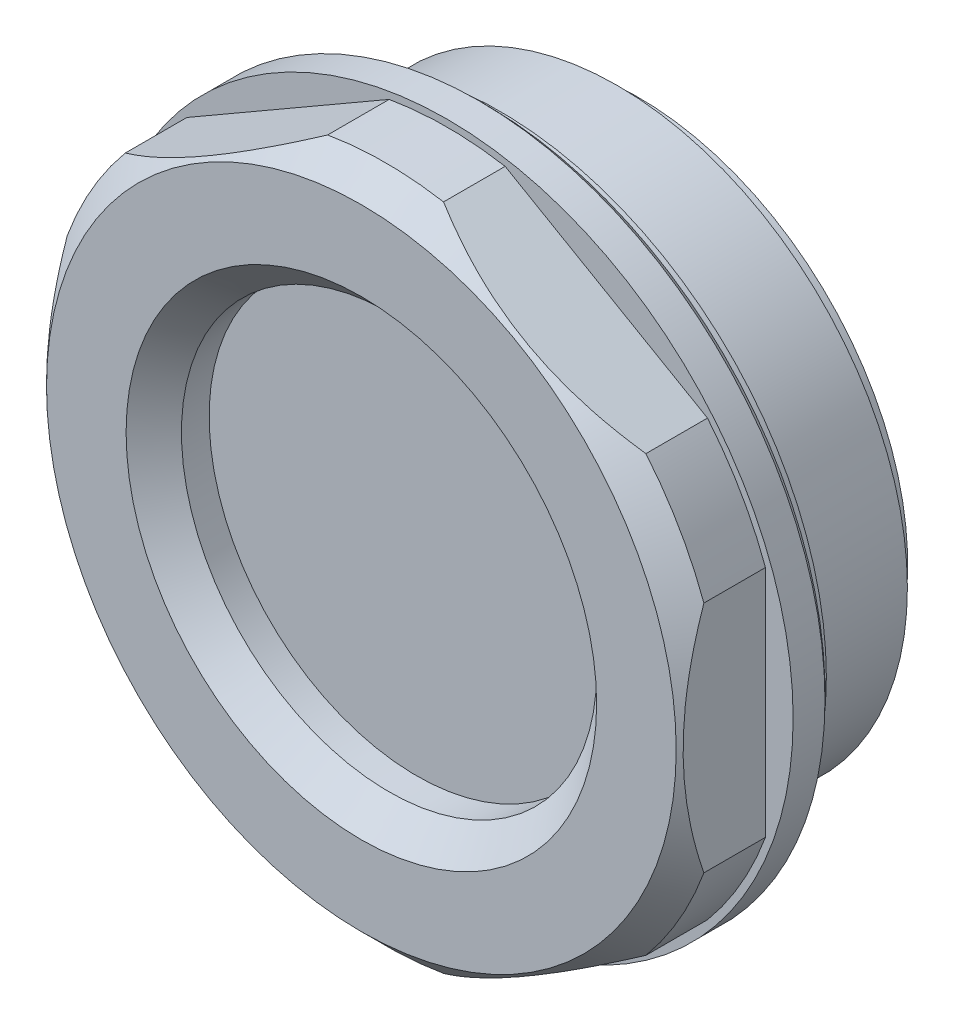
ISO-10303-21;
HEADER;
FILE_DESCRIPTION(('STEP AP214'),'2;1');
FILE_NAME('part.step','',(''),(''),'','','');
FILE_SCHEMA(('AUTOMOTIVE_DESIGN { 1 0 10303 214 1 1 1 1 }'));
ENDSEC;
DATA;
#1=APPLICATION_CONTEXT('core data for automotive mechanical design processes');
#2=APPLICATION_PROTOCOL_DEFINITION('international standard','automotive_design',2000,#1);
#3=PRODUCT_CONTEXT('',#1,'mechanical');
#4=PRODUCT('Part','Part','',(#3));
#5=PRODUCT_RELATED_PRODUCT_CATEGORY('part','',(#4));
#6=PRODUCT_DEFINITION_FORMATION('','',#4);
#7=PRODUCT_DEFINITION_CONTEXT('part definition',#1,'design');
#8=PRODUCT_DEFINITION('design','',#6,#7);
#9=PRODUCT_DEFINITION_SHAPE('','',#8);
#10=(LENGTH_UNIT() NAMED_UNIT(*) SI_UNIT(.MILLI.,.METRE.));
#11=(NAMED_UNIT(*) PLANE_ANGLE_UNIT() SI_UNIT($,.RADIAN.));
#12=(NAMED_UNIT(*) SI_UNIT($,.STERADIAN.) SOLID_ANGLE_UNIT());
#13=UNCERTAINTY_MEASURE_WITH_UNIT(LENGTH_MEASURE(1.E-05),#10,'distance_accuracy_value','');
#14=(GEOMETRIC_REPRESENTATION_CONTEXT(3) GLOBAL_UNCERTAINTY_ASSIGNED_CONTEXT((#13)) GLOBAL_UNIT_ASSIGNED_CONTEXT((#10,
#11,#12)) REPRESENTATION_CONTEXT('',''));
#15=CARTESIAN_POINT('',(0.,0.,0.));
#16=DIRECTION('',(0.,0.,1.));
#17=DIRECTION('',(1.,0.,0.));
#18=AXIS2_PLACEMENT_3D('',#15,#16,#17);
#19=CARTESIAN_POINT('',(0.,0.,-15.6719004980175));
#20=DIRECTION('',(0.,0.,-1.));
#21=DIRECTION('',(-1.,0.,0.));
#22=AXIS2_PLACEMENT_3D('',#19,#20,#21);
#23=CYLINDRICAL_SURFACE('',#22,24.5);
#24=CARTESIAN_POINT('',(0.,0.,8.24999999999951));
#25=DIRECTION('',(0.,0.,-1.));
#26=DIRECTION('',(-1.,0.,0.));
#27=AXIS2_PLACEMENT_3D('',#24,#25,#26);
#28=CIRCLE('',#27,24.5);
#29=CARTESIAN_POINT('',(4.18990418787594,-24.1390700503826,8.24999999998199));
#30=VERTEX_POINT('',#29);
#31=CARTESIAN_POINT('',(-4.18990418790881,-24.1390700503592,8.24999999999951));
#32=VERTEX_POINT('',#31);
#33=EDGE_CURVE('E352',#30,#32,#28,.T.);
#34=ORIENTED_EDGE('',*,*,#33,.T.);
#35=DIRECTION('',(0.,0.,1.));
#36=VECTOR('',#35,1.);
#37=CARTESIAN_POINT('',(-4.18990418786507,-24.1390700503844,3.8));
#38=LINE('',#37,#36);
#39=CARTESIAN_POINT('',(-4.18990418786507,-24.1390700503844,3.8));
#40=VERTEX_POINT('',#39);
#41=EDGE_CURVE('E43',#40,#32,#38,.T.);
#42=ORIENTED_EDGE('',*,*,#41,.F.);
#43=CARTESIAN_POINT('',(0.,0.,3.8));
#44=DIRECTION('',(0.,0.,-1.));
#45=DIRECTION('',(-1.,0.,0.));
#46=AXIS2_PLACEMENT_3D('',#43,#44,#45);
#47=CIRCLE('',#46,24.5);
#48=CARTESIAN_POINT('',(4.18990418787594,-24.1390700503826,3.8));
#49=VERTEX_POINT('',#48);
#50=EDGE_CURVE('E128',#49,#40,#47,.T.);
#51=ORIENTED_EDGE('',*,*,#50,.F.);
#52=DIRECTION('',(0.,0.,1.));
#53=VECTOR('',#52,1.);
#54=CARTESIAN_POINT('',(4.18990418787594,-24.1390700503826,3.8));
#55=LINE('',#54,#53);
#56=EDGE_CURVE('E107',#49,#30,#55,.T.);
#57=ORIENTED_EDGE('',*,*,#56,.T.);
#58=EDGE_LOOP('',(#34,#42,#51,#57));
#59=FACE_BOUND('',#58,.T.);
#60=ADVANCED_FACE('F14',(#59),#23,.T.);
#61=CARTESIAN_POINT('',(-18.8100957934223,-15.698098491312,3.8));
#62=VERTEX_POINT('',#61);
#63=CARTESIAN_POINT('',(-22.9999999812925,-8.44097155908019,3.8));
#64=VERTEX_POINT('',#63);
#65=EDGE_CURVE('E134',#62,#64,#47,.T.);
#66=ORIENTED_EDGE('',*,*,#65,.F.);
#67=DIRECTION('',(0.,0.,1.));
#68=VECTOR('',#67,1.);
#69=CARTESIAN_POINT('',(-18.8100957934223,-15.698098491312,3.8));
#70=LINE('',#69,#68);
#71=CARTESIAN_POINT('',(-18.8100957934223,-15.698098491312,8.24999999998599));
#72=VERTEX_POINT('',#71);
#73=EDGE_CURVE('E316',#62,#72,#70,.T.);
#74=ORIENTED_EDGE('',*,*,#73,.T.);
#75=CARTESIAN_POINT('',(-22.9999999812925,-8.44097155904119,8.24999999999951));
#76=VERTEX_POINT('',#75);
#77=EDGE_CURVE('E348',#72,#76,#28,.T.);
#78=ORIENTED_EDGE('',*,*,#77,.T.);
#79=DIRECTION('',(0.,0.,1.));
#80=VECTOR('',#79,1.);
#81=CARTESIAN_POINT('',(-22.9999999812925,-8.44097155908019,3.8));
#82=LINE('',#81,#80);
#83=EDGE_CURVE('E35',#64,#76,#82,.T.);
#84=ORIENTED_EDGE('',*,*,#83,.F.);
#85=EDGE_LOOP('',(#66,#74,#78,#84));
#86=FACE_BOUND('',#85,.T.);
#87=ADVANCED_FACE('F257',(#86),#23,.T.);
#88=CARTESIAN_POINT('',(-22.9999999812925,8.44097155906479,3.8));
#89=VERTEX_POINT('',#88);
#90=CARTESIAN_POINT('',(-18.8100957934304,15.6980984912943,3.8));
#91=VERTEX_POINT('',#90);
#92=EDGE_CURVE('E139',#89,#91,#47,.T.);
#93=ORIENTED_EDGE('',*,*,#92,.F.);
#94=DIRECTION('',(0.,0.,1.));
#95=VECTOR('',#94,1.);
#96=CARTESIAN_POINT('',(-22.9999999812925,8.44097155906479,3.8));
#97=LINE('',#96,#95);
#98=CARTESIAN_POINT('',(-22.9999999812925,8.44097155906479,8.24999999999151));
#99=VERTEX_POINT('',#98);
#100=EDGE_CURVE('E312',#89,#99,#97,.T.);
#101=ORIENTED_EDGE('',*,*,#100,.T.);
#102=CARTESIAN_POINT('',(-18.81009579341,15.6980984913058,8.24999999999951));
#103=VERTEX_POINT('',#102);
#104=EDGE_CURVE('E138',#99,#103,#28,.T.);
#105=ORIENTED_EDGE('',*,*,#104,.T.);
#106=DIRECTION('',(0.,0.,1.));
#107=VECTOR('',#106,1.);
#108=CARTESIAN_POINT('',(-18.8100957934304,15.6980984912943,3.8));
#109=LINE('',#108,#107);
#110=EDGE_CURVE('E306',#91,#103,#109,.T.);
#111=ORIENTED_EDGE('',*,*,#110,.F.);
#112=EDGE_LOOP('',(#93,#101,#105,#111));
#113=FACE_BOUND('',#112,.T.);
#114=ADVANCED_FACE('F262',(#113),#23,.T.);
#115=CARTESIAN_POINT('',(-4.18990418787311,24.1390700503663,3.8));
#116=VERTEX_POINT('',#115);
#117=CARTESIAN_POINT('',(4.18990418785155,24.1390700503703,3.8));
#118=VERTEX_POINT('',#117);
#119=EDGE_CURVE('E143',#116,#118,#47,.T.);
#120=ORIENTED_EDGE('',*,*,#119,.F.);
#121=DIRECTION('',(0.,0.,1.));
#122=VECTOR('',#121,1.);
#123=CARTESIAN_POINT('',(-4.18990418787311,24.1390700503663,3.8));
#124=LINE('',#123,#122);
#125=CARTESIAN_POINT('',(-4.18990418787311,24.1390700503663,8.24999999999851));
#126=VERTEX_POINT('',#125);
#127=EDGE_CURVE('E301',#116,#126,#124,.T.);
#128=ORIENTED_EDGE('',*,*,#127,.T.);
#129=CARTESIAN_POINT('',(4.18990418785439,24.1390700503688,8.24999999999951));
#130=VERTEX_POINT('',#129);
#131=EDGE_CURVE('E304',#126,#130,#28,.T.);
#132=ORIENTED_EDGE('',*,*,#131,.T.);
#133=DIRECTION('',(0.,0.,1.));
#134=VECTOR('',#133,1.);
#135=CARTESIAN_POINT('',(4.18990418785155,24.1390700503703,3.8));
#136=LINE('',#135,#134);
#137=EDGE_CURVE('E303',#118,#130,#136,.T.);
#138=ORIENTED_EDGE('',*,*,#137,.F.);
#139=EDGE_LOOP('',(#120,#128,#132,#138));
#140=FACE_BOUND('',#139,.T.);
#141=ADVANCED_FACE('F274',(#140),#23,.T.);
#142=CARTESIAN_POINT('',(18.8100957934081,15.6980984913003,3.8));
#143=VERTEX_POINT('',#142);
#144=CARTESIAN_POINT('',(22.9999999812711,8.4409715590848,3.8));
#145=VERTEX_POINT('',#144);
#146=EDGE_CURVE('E136',#143,#145,#47,.T.);
#147=ORIENTED_EDGE('',*,*,#146,.F.);
#148=DIRECTION('',(0.,0.,1.));
#149=VECTOR('',#148,1.);
#150=CARTESIAN_POINT('',(18.8100957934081,15.6980984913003,3.8));
#151=LINE('',#150,#149);
#152=CARTESIAN_POINT('',(18.8100957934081,15.6980984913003,8.2500000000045));
#153=VERTEX_POINT('',#152);
#154=EDGE_CURVE('E289',#143,#153,#151,.T.);
#155=ORIENTED_EDGE('',*,*,#154,.T.);
#156=CARTESIAN_POINT('',(22.9999999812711,8.44097155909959,8.24999999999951));
#157=VERTEX_POINT('',#156);
#158=EDGE_CURVE('E359',#153,#157,#28,.T.);
#159=ORIENTED_EDGE('',*,*,#158,.T.);
#160=DIRECTION('',(0.,0.,1.));
#161=VECTOR('',#160,1.);
#162=CARTESIAN_POINT('',(22.9999999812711,8.4409715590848,3.8));
#163=LINE('',#162,#161);
#164=EDGE_CURVE('E291',#145,#157,#163,.T.);
#165=ORIENTED_EDGE('',*,*,#164,.F.);
#166=EDGE_LOOP('',(#147,#155,#159,#165));
#167=FACE_BOUND('',#166,.T.);
#168=ADVANCED_FACE('F267',(#167),#23,.T.);
#169=CARTESIAN_POINT('',(0.,24.5,1.));
#170=DIRECTION('',(0.,0.,1.));
#171=DIRECTION('',(1.,0.,0.));
#172=AXIS2_PLACEMENT_3D('',#169,#170,#171);
#173=PLANE('',#172);
#174=CARTESIAN_POINT('',(0.,0.,1.));
#175=DIRECTION('',(0.,0.,-1.));
#176=DIRECTION('',(-1.,0.,0.));
#177=AXIS2_PLACEMENT_3D('',#174,#175,#176);
#178=CIRCLE('',#177,23.6);
#179=CARTESIAN_POINT('',(-23.6,0.,1.));
#180=VERTEX_POINT('',#179);
#181=EDGE_CURVE('E329',#180,#180,#178,.T.);
#182=ORIENTED_EDGE('',*,*,#181,.F.);
#183=EDGE_LOOP('',(#182));
#184=FACE_BOUND('',#183,.T.);
#185=CARTESIAN_POINT('',(0.,0.,1.));
#186=DIRECTION('',(0.,0.,-1.));
#187=DIRECTION('',(-1.,0.,0.));
#188=AXIS2_PLACEMENT_3D('',#185,#186,#187);
#189=CIRCLE('',#188,24.5);
#190=CARTESIAN_POINT('',(-24.5,0.,1.));
#191=VERTEX_POINT('',#190);
#192=EDGE_CURVE('E150',#191,#191,#189,.T.);
#193=ORIENTED_EDGE('',*,*,#192,.T.);
#194=EDGE_LOOP('',(#193));
#195=FACE_BOUND('',#194,.T.);
#196=ADVANCED_FACE('F16',(#184,#195),#173,.F.);
#197=CARTESIAN_POINT('',(0.,0.,1.));
#198=DIRECTION('',(0.,0.,1.));
#199=DIRECTION('',(1.,0.,0.));
#200=AXIS2_PLACEMENT_3D('',#197,#198,#199);
#201=CONICAL_SURFACE('',#200,24.5,0.785398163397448);
#202=CARTESIAN_POINT('',(0.,0.,1.5));
#203=DIRECTION('',(0.,0.,-1.));
#204=DIRECTION('',(-1.,0.,0.));
#205=AXIS2_PLACEMENT_3D('',#202,#203,#204);
#206=CIRCLE('',#205,25.);
#207=CARTESIAN_POINT('',(-25.,0.,1.5));
#208=VERTEX_POINT('',#207);
#209=EDGE_CURVE('E147',#208,#208,#206,.T.);
#210=ORIENTED_EDGE('',*,*,#209,.T.);
#211=EDGE_LOOP('',(#210));
#212=FACE_BOUND('',#211,.T.);
#213=ORIENTED_EDGE('',*,*,#192,.F.);
#214=EDGE_LOOP('',(#213));
#215=FACE_BOUND('',#214,.T.);
#216=ADVANCED_FACE('F281',(#212,#215),#201,.T.);
#217=CARTESIAN_POINT('',(0.,0.,-15.6719004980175));
#218=DIRECTION('',(0.,0.,-1.));
#219=DIRECTION('',(-1.,0.,0.));
#220=AXIS2_PLACEMENT_3D('',#217,#218,#219);
#221=CYLINDRICAL_SURFACE('',#220,25.);
#222=ORIENTED_EDGE('',*,*,#209,.F.);
#223=EDGE_LOOP('',(#222));
#224=FACE_BOUND('',#223,.T.);
#225=CARTESIAN_POINT('',(0.,0.,3.8));
#226=DIRECTION('',(0.,0.,-1.));
#227=DIRECTION('',(-1.,0.,0.));
#228=AXIS2_PLACEMENT_3D('',#225,#226,#227);
#229=CIRCLE('',#228,25.);
#230=CARTESIAN_POINT('',(-25.,0.,3.8));
#231=VERTEX_POINT('',#230);
#232=EDGE_CURVE('E142',#231,#231,#229,.T.);
#233=ORIENTED_EDGE('',*,*,#232,.T.);
#234=EDGE_LOOP('',(#233));
#235=FACE_BOUND('',#234,.T.);
#236=ADVANCED_FACE('F272',(#224,#235),#221,.T.);
#237=CARTESIAN_POINT('',(0.,25.,3.8));
#238=DIRECTION('',(0.,0.,1.));
#239=DIRECTION('',(1.,0.,0.));
#240=AXIS2_PLACEMENT_3D('',#237,#238,#239);
#241=PLANE('',#240);
#242=ORIENTED_EDGE('',*,*,#92,.T.);
#243=DIRECTION('',(0.866025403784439,0.5,0.));
#244=VECTOR('',#243,1.);
#245=CARTESIAN_POINT('',(-18.8100957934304,15.6980984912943,3.8));
#246=LINE('',#245,#244);
#247=EDGE_CURVE('E297',#91,#116,#246,.T.);
#248=ORIENTED_EDGE('',*,*,#247,.T.);
#249=ORIENTED_EDGE('',*,*,#119,.T.);
#250=DIRECTION('',(0.866025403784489,-0.499999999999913,0.));
#251=VECTOR('',#250,1.);
#252=CARTESIAN_POINT('',(4.18990418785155,24.1390700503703,3.8));
#253=LINE('',#252,#251);
#254=EDGE_CURVE('E296',#118,#143,#253,.T.);
#255=ORIENTED_EDGE('',*,*,#254,.T.);
#256=ORIENTED_EDGE('',*,*,#146,.T.);
#257=DIRECTION('',(0.,-1.,0.));
#258=VECTOR('',#257,1.);
#259=CARTESIAN_POINT('',(22.9999999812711,8.4409715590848,3.8));
#260=LINE('',#259,#258);
#261=CARTESIAN_POINT('',(22.9999999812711,-8.44097155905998,3.8));
#262=VERTEX_POINT('',#261);
#263=EDGE_CURVE('E132',#145,#262,#260,.T.);
#264=ORIENTED_EDGE('',*,*,#263,.T.);
#265=CARTESIAN_POINT('',(18.8100957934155,-15.6980984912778,3.8));
#266=VERTEX_POINT('',#265);
#267=EDGE_CURVE('E131',#262,#266,#47,.T.);
#268=ORIENTED_EDGE('',*,*,#267,.T.);
#269=DIRECTION('',(-0.866025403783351,-0.500000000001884,0.));
#270=VECTOR('',#269,1.);
#271=CARTESIAN_POINT('',(18.8100957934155,-15.6980984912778,3.8));
#272=LINE('',#271,#270);
#273=EDGE_CURVE('E110',#266,#49,#272,.T.);
#274=ORIENTED_EDGE('',*,*,#273,.T.);
#275=ORIENTED_EDGE('',*,*,#50,.T.);
#276=DIRECTION('',(-0.866025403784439,0.5,0.));
#277=VECTOR('',#276,1.);
#278=CARTESIAN_POINT('',(-4.18990418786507,-24.1390700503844,3.8));
#279=LINE('',#278,#277);
#280=EDGE_CURVE('E119',#40,#62,#279,.T.);
#281=ORIENTED_EDGE('',*,*,#280,.T.);
#282=ORIENTED_EDGE('',*,*,#65,.T.);
#283=DIRECTION('',(0.,1.,0.));
#284=VECTOR('',#283,1.);
#285=CARTESIAN_POINT('',(-22.9999999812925,-8.44097155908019,3.8));
#286=LINE('',#285,#284);
#287=EDGE_CURVE('E367',#64,#89,#286,.T.);
#288=ORIENTED_EDGE('',*,*,#287,.T.);
#289=EDGE_LOOP('',(#242,#248,#249,#255,#256,#264,#268,#274,#275,#281,#282,#288));
#290=FACE_BOUND('',#289,.T.);
#291=ORIENTED_EDGE('',*,*,#232,.F.);
#292=EDGE_LOOP('',(#291));
#293=FACE_BOUND('',#292,.T.);
#294=ADVANCED_FACE('F125',(#290,#293),#241,.T.);
#295=ORIENTED_EDGE('',*,*,#267,.F.);
#296=DIRECTION('',(0.,0.,1.));
#297=VECTOR('',#296,1.);
#298=CARTESIAN_POINT('',(22.9999999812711,-8.44097155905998,3.8));
#299=LINE('',#298,#297);
#300=CARTESIAN_POINT('',(22.9999999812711,-8.44097155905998,8.2500000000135));
#301=VERTEX_POINT('',#300);
#302=EDGE_CURVE('E363',#262,#301,#299,.T.);
#303=ORIENTED_EDGE('',*,*,#302,.T.);
#304=CARTESIAN_POINT('',(18.8100957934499,-15.698098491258,8.24999999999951));
#305=VERTEX_POINT('',#304);
#306=EDGE_CURVE('E354',#301,#305,#28,.T.);
#307=ORIENTED_EDGE('',*,*,#306,.T.);
#308=DIRECTION('',(0.,0.,1.));
#309=VECTOR('',#308,1.);
#310=CARTESIAN_POINT('',(18.8100957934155,-15.698098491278,3.8));
#311=LINE('',#310,#309);
#312=EDGE_CURVE('E118',#266,#305,#311,.T.);
#313=ORIENTED_EDGE('',*,*,#312,.F.);
#314=EDGE_LOOP('',(#295,#303,#307,#313));
#315=FACE_BOUND('',#314,.T.);
#316=ADVANCED_FACE('F252',(#315),#23,.T.);
#317=CARTESIAN_POINT('',(0.,0.,10.));
#318=DIRECTION('',(0.,0.,-1.));
#319=DIRECTION('',(-1.,0.,0.));
#320=AXIS2_PLACEMENT_3D('',#317,#318,#319);
#321=CONICAL_SURFACE('',#320,22.75,0.785398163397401);
#322=ORIENTED_EDGE('',*,*,#77,.F.);
#323=CARTESIAN_POINT('',(-18.8102957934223,-15.6979830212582,8.24992043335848));
#324=CARTESIAN_POINT('',(-18.4998168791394,-15.8772381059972,8.37344730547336));
#325=CARTESIAN_POINT('',(-18.1874496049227,-16.0575834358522,8.49077806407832));
#326=CARTESIAN_POINT('',(-17.5590441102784,-16.4203935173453,8.71190524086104));
#327=CARTESIAN_POINT('',(-17.2430047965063,-16.6028589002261,8.8156975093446));
#328=CARTESIAN_POINT('',(-16.6069457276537,-16.9700877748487,9.00871231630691));
#329=CARTESIAN_POINT('',(-16.2869195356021,-17.1548549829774,9.09790671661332));
#330=CARTESIAN_POINT('',(-15.6438649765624,-17.5261227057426,9.26033670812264));
#331=CARTESIAN_POINT('',(-15.320836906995,-17.7126230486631,9.33357386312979));
#332=CARTESIAN_POINT('',(-14.6823502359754,-18.0812535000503,9.46104417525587));
#333=CARTESIAN_POINT('',(-14.3669700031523,-18.2633383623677,9.51579906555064));
#334=CARTESIAN_POINT('',(-13.7343704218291,-18.628569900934,9.60857987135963));
#335=CARTESIAN_POINT('',(-13.4171511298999,-18.8117165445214,9.64660629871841));
#336=CARTESIAN_POINT('',(-12.7818191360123,-19.1785256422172,9.70532175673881));
#337=CARTESIAN_POINT('',(-12.4637076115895,-19.3621874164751,9.72602771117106));
#338=CARTESIAN_POINT('',(-11.8269943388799,-19.7297939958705,9.7498350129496));
#339=CARTESIAN_POINT('',(-11.5083926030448,-19.9137387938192,9.75293680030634));
#340=CARTESIAN_POINT('',(-10.8964793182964,-20.2670270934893,9.74193955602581));
#341=CARTESIAN_POINT('',(-10.603149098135,-20.436381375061,9.72917390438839));
#342=CARTESIAN_POINT('',(-10.0172242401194,-20.7746652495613,9.6888322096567));
#343=CARTESIAN_POINT('',(-9.72462968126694,-20.9435947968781,9.66125463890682));
#344=CARTESIAN_POINT('',(-9.14052195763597,-21.2808295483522,9.59162699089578));
#345=CARTESIAN_POINT('',(-8.84900974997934,-21.4491341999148,9.54956625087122));
#346=CARTESIAN_POINT('',(-8.26774670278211,-21.7847265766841,9.45150828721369));
#347=CARTESIAN_POINT('',(-7.97799591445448,-21.952014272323,9.39551066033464));
#348=CARTESIAN_POINT('',(-7.39207661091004,-22.2902949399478,9.26838191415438));
#349=CARTESIAN_POINT('',(-7.0959734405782,-22.4612501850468,9.19685032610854));
#350=CARTESIAN_POINT('',(-6.50638700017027,-22.8016480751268,9.04054110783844));
#351=CARTESIAN_POINT('',(-6.21290392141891,-22.9710906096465,8.95576251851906));
#352=CARTESIAN_POINT('',(-5.62932281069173,-23.3080213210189,8.77401103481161));
#353=CARTESIAN_POINT('',(-5.33921993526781,-23.4755122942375,8.67705878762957));
#354=CARTESIAN_POINT('',(-4.762116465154,-23.808703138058,8.47178790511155));
#355=CARTESIAN_POINT('',(-4.47511515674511,-23.9744034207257,8.36347194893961));
#356=CARTESIAN_POINT('',(-4.18970418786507,-24.1391855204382,8.24992043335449));
#357=B_SPLINE_CURVE_WITH_KNOTS('',3,(#323,#324,#325,#326,#327,#328,#329,#330,#331,#332,#333,
#334,#335,#336,#337,#338,#339,#340,#341,#342,#343,#344,#345,#346,#347,#348,#349,#350,#351,#352,
#353,#354,#355,#356),.UNSPECIFIED.,.F.,.F.,(4,2,2,2,2,2,2,2,2,2,2,2,2,2,2,2,4),(0.,
1.13759069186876,2.27552925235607,3.41563605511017,4.55563107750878,5.66005032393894,
6.76443577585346,7.86774087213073,8.97101839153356,9.98754144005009,11.0041693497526,
12.0215473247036,13.0389547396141,14.0866135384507,15.1343482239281,16.1803293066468,
17.2260643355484),.UNSPECIFIED.);
#358=EDGE_CURVE('E9',#72,#32,#357,.T.);
#359=ORIENTED_EDGE('',*,*,#358,.T.);
#360=ORIENTED_EDGE('',*,*,#33,.F.);
#361=CARTESIAN_POINT('',(4.18970418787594,-24.1391855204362,8.24992043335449));
#362=CARTESIAN_POINT('',(4.50018310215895,-23.9599304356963,8.37344730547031));
#363=CARTESIAN_POINT('',(4.81255037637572,-23.7795851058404,8.4907780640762));
#364=CARTESIAN_POINT('',(5.44095587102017,-23.4167750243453,8.71190524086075));
#365=CARTESIAN_POINT('',(5.75699518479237,-23.2343096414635,8.8156975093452));
#366=CARTESIAN_POINT('',(6.39305425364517,-22.867080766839,9.00871231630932));
#367=CARTESIAN_POINT('',(6.71308044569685,-22.6823135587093,9.09790671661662));
#368=CARTESIAN_POINT('',(7.35613500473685,-22.3110458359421,9.2603367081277));
#369=CARTESIAN_POINT('',(7.67916307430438,-22.1245454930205,9.33357386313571));
#370=CARTESIAN_POINT('',(8.3176497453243,-21.7559150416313,9.46104417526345));
#371=CARTESIAN_POINT('',(8.6330299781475,-21.5738301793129,9.51579906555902));
#372=CARTESIAN_POINT('',(9.26562955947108,-21.2085986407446,9.60857987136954));
#373=CARTESIAN_POINT('',(9.58284885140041,-21.0254519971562,9.64660629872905));
#374=CARTESIAN_POINT('',(10.2181808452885,-20.6586428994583,9.70532175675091));
#375=CARTESIAN_POINT('',(10.5362923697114,-20.4749811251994,9.72602771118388));
#376=CARTESIAN_POINT('',(11.1730056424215,-20.1073745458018,9.74983501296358));
#377=CARTESIAN_POINT('',(11.4916073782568,-19.9234297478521,9.75293680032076));
#378=CARTESIAN_POINT('',(12.1035206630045,-19.5701414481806,9.74193955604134));
#379=CARTESIAN_POINT('',(12.396850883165,-19.4007871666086,9.72917390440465));
#380=CARTESIAN_POINT('',(12.9827757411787,-19.0625032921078,9.68883220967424));
#381=CARTESIAN_POINT('',(13.2753703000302,-18.8935737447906,9.66125463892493));
#382=CARTESIAN_POINT('',(13.8594780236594,-18.5563389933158,9.5916269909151));
#383=CARTESIAN_POINT('',(14.1509902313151,-18.3880343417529,9.54956625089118));
#384=CARTESIAN_POINT('',(14.7322532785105,-18.0524419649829,9.45150828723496));
#385=CARTESIAN_POINT('',(15.0220040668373,-17.8851542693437,9.39551066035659));
#386=CARTESIAN_POINT('',(15.6079233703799,-17.5468736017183,9.26838191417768));
#387=CARTESIAN_POINT('',(15.9040265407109,-17.375918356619,9.19685032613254));
#388=CARTESIAN_POINT('',(16.4936129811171,-17.0355204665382,9.04054110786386));
#389=CARTESIAN_POINT('',(16.7870960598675,-16.8660779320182,8.95576251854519));
#390=CARTESIAN_POINT('',(17.370677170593,-16.5291472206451,8.77401103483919));
#391=CARTESIAN_POINT('',(17.6607800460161,-16.3616562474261,8.67705878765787));
#392=CARTESIAN_POINT('',(18.2378835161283,-16.0284654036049,8.47178790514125));
#393=CARTESIAN_POINT('',(18.5248848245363,-15.8627651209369,8.36347194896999));
#394=CARTESIAN_POINT('',(18.8102957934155,-15.697983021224,8.24992043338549));
#395=B_SPLINE_CURVE_WITH_KNOTS('',3,(#361,#362,#363,#364,#365,#366,#367,#368,#369,#370,#371,
#372,#373,#374,#375,#376,#377,#378,#379,#380,#381,#382,#383,#384,#385,#386,#387,#388,#389,#390,
#391,#392,#393,#394),.UNSPECIFIED.,.F.,.F.,(4,2,2,2,2,2,2,2,2,2,2,2,2,2,2,2,4),(0.,
1.13759069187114,2.27552925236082,3.41563605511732,4.55563107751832,5.66005032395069,
6.76443577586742,7.8677408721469,8.97101839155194,9.98754144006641,11.0041693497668,
12.0215473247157,13.0389547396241,14.0866135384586,15.1343482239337,16.1803293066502,
17.2260643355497),.UNSPECIFIED.);
#396=EDGE_CURVE('E113',#30,#305,#395,.T.);
#397=ORIENTED_EDGE('',*,*,#396,.T.);
#398=ORIENTED_EDGE('',*,*,#306,.F.);
#399=CARTESIAN_POINT('',(22.9999999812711,-17.245280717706,4.00283133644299));
#400=CARTESIAN_POINT('',(22.9999999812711,-16.8196596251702,4.25812290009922));
#401=CARTESIAN_POINT('',(22.9999999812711,-16.3913698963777,4.50903558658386));
#402=CARTESIAN_POINT('',(22.9999999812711,-15.5288936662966,5.00075792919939));
#403=CARTESIAN_POINT('',(22.9999999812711,-15.0947057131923,5.24156503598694));
#404=CARTESIAN_POINT('',(22.9999999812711,-14.2182669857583,5.71257935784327));
#405=CARTESIAN_POINT('',(22.9999999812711,-13.775990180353,5.9427382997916));
#406=CARTESIAN_POINT('',(22.9999999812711,-12.88473576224,6.38965592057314));
#407=CARTESIAN_POINT('',(22.9999999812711,-12.4357585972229,6.60641548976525));
#408=CARTESIAN_POINT('',(22.9999999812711,-11.5222293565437,7.02851796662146));
#409=CARTESIAN_POINT('',(22.9999999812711,-11.0575430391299,7.23357148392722));
#410=CARTESIAN_POINT('',(22.9999999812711,-10.12046908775,7.62545504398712));
#411=CARTESIAN_POINT('',(22.9999999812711,-9.64808078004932,7.81228348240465));
#412=CARTESIAN_POINT('',(22.9999999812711,-8.69630794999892,8.16482692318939));
#413=CARTESIAN_POINT('',(22.9999999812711,-8.2169358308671,8.330575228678));
#414=CARTESIAN_POINT('',(22.9999999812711,-7.25074606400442,8.63851524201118));
#415=CARTESIAN_POINT('',(22.9999999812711,-6.76392974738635,8.78071110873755));
#416=CARTESIAN_POINT('',(22.9999999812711,-5.70081996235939,9.0604627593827));
#417=CARTESIAN_POINT('',(22.9999999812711,-5.12324637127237,9.19321709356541));
#418=CARTESIAN_POINT('',(22.9999999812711,-3.96020628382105,9.41852095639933));
#419=CARTESIAN_POINT('',(22.9999999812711,-3.37473941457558,9.51106857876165));
#420=CARTESIAN_POINT('',(22.9999999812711,-2.20381796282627,9.65190227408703));
#421=CARTESIAN_POINT('',(22.9999999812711,-1.6184108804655,9.70057996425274));
#422=CARTESIAN_POINT('',(22.9999999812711,-0.445499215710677,9.7531419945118));
#423=CARTESIAN_POINT('',(22.9999999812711,0.142005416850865,9.75702525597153));
#424=CARTESIAN_POINT('',(22.9999999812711,1.07030158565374,9.72764940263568));
#425=CARTESIAN_POINT('',(22.9999999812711,1.41163347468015,9.70922822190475));
#426=CARTESIAN_POINT('',(22.9999999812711,2.09318524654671,9.6574459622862));
#427=CARTESIAN_POINT('',(22.9999999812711,2.43340509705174,9.62408445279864));
#428=CARTESIAN_POINT('',(22.9999999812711,3.11213976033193,9.54284890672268));
#429=CARTESIAN_POINT('',(22.9999999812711,3.4506543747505,9.49497321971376));
#430=CARTESIAN_POINT('',(22.9999999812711,4.12543657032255,9.38531903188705));
#431=CARTESIAN_POINT('',(22.9999999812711,4.46170391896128,9.32353911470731));
#432=CARTESIAN_POINT('',(22.9999999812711,5.47525343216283,9.11660123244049));
#433=CARTESIAN_POINT('',(22.9999999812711,6.14842922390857,8.95093249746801));
#434=CARTESIAN_POINT('',(22.9999999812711,7.48093422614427,8.57241125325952));
#435=CARTESIAN_POINT('',(22.9999999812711,8.14026657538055,8.35956956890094));
#436=CARTESIAN_POINT('',(22.9999999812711,9.65848661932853,7.8174587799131));
#437=CARTESIAN_POINT('',(22.9999999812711,10.5118981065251,7.47289951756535));
#438=CARTESIAN_POINT('',(22.9999999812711,12.1943515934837,6.72823332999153));
#439=CARTESIAN_POINT('',(22.9999999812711,13.023377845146,6.32809142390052));
#440=CARTESIAN_POINT('',(22.9999999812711,14.6623410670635,5.48299891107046));
#441=CARTESIAN_POINT('',(22.9999999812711,15.4721868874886,5.03787300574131));
#442=CARTESIAN_POINT('',(22.9999999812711,17.0720137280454,4.11387954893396));
#443=CARTESIAN_POINT('',(22.9999999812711,17.861998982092,3.63501927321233));
#444=CARTESIAN_POINT('',(22.9999999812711,19.3859565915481,2.67537659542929));
#445=CARTESIAN_POINT('',(22.9999999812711,20.1207517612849,2.19589364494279));
#446=CARTESIAN_POINT('',(22.9999999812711,21.5774002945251,1.21758703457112));
#447=CARTESIAN_POINT('',(22.9999999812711,22.2992524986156,0.718761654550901));
#448=CARTESIAN_POINT('',(22.9999999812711,23.7248215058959,-0.289610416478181));
#449=CARTESIAN_POINT('',(22.9999999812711,24.4286466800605,-0.799004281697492));
#450=CARTESIAN_POINT('',(22.9999999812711,25.477255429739,-1.57251448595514));
#451=CARTESIAN_POINT('',(22.9999999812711,25.8255555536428,-1.83188438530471));
#452=CARTESIAN_POINT('',(22.9999999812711,26.5199753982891,-2.35351298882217));
#453=CARTESIAN_POINT('',(22.9999999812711,26.8660951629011,-2.61577163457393));
#454=CARTESIAN_POINT('',(22.9999999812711,27.2112128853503,-2.879343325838));
#455=B_SPLINE_CURVE_WITH_KNOTS('',3,(#399,#400,#401,#402,#403,#404,#405,#406,#407,#408,#409,
#410,#411,#412,#413,#414,#415,#416,#417,#418,#419,#420,#421,#422,#423,#424,#425,#426,#427,#428,
#429,#430,#431,#432,#433,#434,#435,#436,#437,#438,#439,#440,#441,#442,#443,#444,#445,#446,#447,
#448,#449,#450,#451,#452,#453,#454),.UNSPECIFIED.,.F.,.F.,(4,2,2,2,2,2,2,2,2,2,2,2,2,2,2,2,2,2,
2,2,2,2,2,2,2,2,2,4),(0.,1.48896771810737,2.97830882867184,4.47384681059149,5.96928531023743,
7.49269617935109,9.01624103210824,10.5373482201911,12.0581865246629,13.8347744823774,
15.6114466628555,17.3720971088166,19.1327899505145,20.157984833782,21.1832092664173,
22.2085503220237,23.2339958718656,25.3115691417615,27.3886661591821,30.1470220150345,
32.9071217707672,35.6784256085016,38.4491335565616,41.080961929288,43.7130248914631,
46.319312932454,47.6220945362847,48.9248498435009),.UNSPECIFIED.);
#456=EDGE_CURVE('E159',#301,#157,#455,.T.);
#457=ORIENTED_EDGE('',*,*,#456,.T.);
#458=ORIENTED_EDGE('',*,*,#158,.F.);
#459=CARTESIAN_POINT('',(18.8102957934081,15.6979830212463,8.249920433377));
#460=CARTESIAN_POINT('',(18.4998168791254,15.8772381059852,8.37344730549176));
#461=CARTESIAN_POINT('',(18.1874496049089,16.0575834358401,8.49077806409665));
#462=CARTESIAN_POINT('',(17.559044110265,16.4203935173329,8.71190524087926));
#463=CARTESIAN_POINT('',(17.2430047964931,16.6028589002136,8.81569750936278));
#464=CARTESIAN_POINT('',(16.6069457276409,16.9700877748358,9.00871231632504));
#465=CARTESIAN_POINT('',(16.2869195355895,17.1548549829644,9.09790671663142));
#466=CARTESIAN_POINT('',(15.6438649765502,17.5261227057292,9.2603367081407));
#467=CARTESIAN_POINT('',(15.320836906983,17.7126230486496,9.33357386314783));
#468=CARTESIAN_POINT('',(14.6823502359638,18.0812535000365,9.46104417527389));
#469=CARTESIAN_POINT('',(14.366970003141,18.2633383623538,9.51579906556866));
#470=CARTESIAN_POINT('',(13.7343704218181,18.6285699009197,9.60857987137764));
#471=CARTESIAN_POINT('',(13.4171511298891,18.811716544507,9.64660629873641));
#472=CARTESIAN_POINT('',(12.7818191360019,19.1785256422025,9.70532175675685));
#473=CARTESIAN_POINT('',(12.4637076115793,19.3621874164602,9.72602771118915));
#474=CARTESIAN_POINT('',(11.82699433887,19.7297939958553,9.74983501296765));
#475=CARTESIAN_POINT('',(11.5083926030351,19.9137387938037,9.7529368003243));
#476=CARTESIAN_POINT('',(10.8964793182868,20.2670270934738,9.74193955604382));
#477=CARTESIAN_POINT('',(10.6031490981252,20.4363813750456,9.72917390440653));
#478=CARTESIAN_POINT('',(10.0172242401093,20.774665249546,9.6888322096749));
#479=CARTESIAN_POINT('',(9.72462968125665,20.9435947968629,9.66125463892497));
#480=CARTESIAN_POINT('',(9.14052195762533,21.2808295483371,9.59162699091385));
#481=CARTESIAN_POINT('',(8.84900974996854,21.4491341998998,9.54956625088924));
#482=CARTESIAN_POINT('',(8.26774670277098,21.7847265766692,9.4515082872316));
#483=CARTESIAN_POINT('',(7.97799591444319,21.9520142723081,9.39551066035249));
#484=CARTESIAN_POINT('',(7.39207661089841,22.290294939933,9.26838191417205));
#485=CARTESIAN_POINT('',(7.0959734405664,22.4612501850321,9.19685032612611));
#486=CARTESIAN_POINT('',(6.50638700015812,22.8016480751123,9.04054110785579));
#487=CARTESIAN_POINT('',(6.2129039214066,22.971090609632,8.95576251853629));
#488=CARTESIAN_POINT('',(5.62932281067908,23.3080213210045,8.7740110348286));
#489=CARTESIAN_POINT('',(5.33921993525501,23.4755122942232,8.67705878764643));
#490=CARTESIAN_POINT('',(4.76211646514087,23.8087031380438,8.47178790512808));
#491=CARTESIAN_POINT('',(4.4751151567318,23.9744034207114,8.36347194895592));
#492=CARTESIAN_POINT('',(4.18970418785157,24.1391855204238,8.2499204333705));
#493=B_SPLINE_CURVE_WITH_KNOTS('',3,(#459,#460,#461,#462,#463,#464,#465,#466,#467,#468,#469,
#470,#471,#472,#473,#474,#475,#476,#477,#478,#479,#480,#481,#482,#483,#484,#485,#486,#487,#488,
#489,#490,#491,#492),.UNSPECIFIED.,.F.,.F.,(4,2,2,2,2,2,2,2,2,2,2,2,2,2,2,2,4),(0.,
1.13759069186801,2.27552925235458,3.41563605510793,4.55563107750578,5.66005032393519,
6.76443577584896,7.8677408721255,8.9710183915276,9.98754144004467,11.0041693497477,
12.0215473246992,13.0389547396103,14.0866135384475,15.1343482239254,16.1803293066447,
17.226064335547),.UNSPECIFIED.);
#494=EDGE_CURVE('E186',#153,#130,#493,.T.);
#495=ORIENTED_EDGE('',*,*,#494,.T.);
#496=ORIENTED_EDGE('',*,*,#131,.F.);
#497=CARTESIAN_POINT('',(-4.18970418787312,24.1391855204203,8.2499204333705));
#498=CARTESIAN_POINT('',(-4.50018310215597,23.9599304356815,8.37344730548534));
#499=CARTESIAN_POINT('',(-4.81255037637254,23.7795851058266,8.49077806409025));
#500=CARTESIAN_POINT('',(-5.44095587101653,23.4167750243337,8.71190524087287));
#501=CARTESIAN_POINT('',(-5.75699518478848,23.234309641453,8.81569750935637));
#502=CARTESIAN_POINT('',(-6.39305425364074,22.8670807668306,9.00871231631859));
#503=CARTESIAN_POINT('',(-6.71308044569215,22.682313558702,9.09790671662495));
#504=CARTESIAN_POINT('',(-7.35613500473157,22.311045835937,9.2603367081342));
#505=CARTESIAN_POINT('',(-7.6791630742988,22.1245454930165,9.33357386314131));
#506=CARTESIAN_POINT('',(-8.3176497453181,21.7559150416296,9.46104417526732));
#507=CARTESIAN_POINT('',(-8.633029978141,21.5738301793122,9.51579906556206));
#508=CARTESIAN_POINT('',(-9.26562955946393,21.2085986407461,9.60857987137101));
#509=CARTESIAN_POINT('',(-9.58284885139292,21.0254519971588,9.64660629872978));
#510=CARTESIAN_POINT('',(-10.2181808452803,20.6586428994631,9.70532175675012));
#511=CARTESIAN_POINT('',(-10.5362923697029,20.4749811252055,9.72602771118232));
#512=CARTESIAN_POINT('',(-11.1730056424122,20.1073745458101,9.74983501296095));
#513=CARTESIAN_POINT('',(-11.491607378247,19.9234297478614,9.75293680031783));
#514=CARTESIAN_POINT('',(-12.1035206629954,19.5701414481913,9.74193955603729));
#515=CARTESIAN_POINT('',(-12.396850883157,19.4007871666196,9.72917390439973));
#516=CARTESIAN_POINT('',(-12.9827757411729,19.0625032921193,9.68883220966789));
#517=CARTESIAN_POINT('',(-13.2753703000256,18.8935737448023,9.66125463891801));
#518=CARTESIAN_POINT('',(-13.8594780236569,18.556338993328,9.59162699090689));
#519=CARTESIAN_POINT('',(-14.1509902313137,18.3880343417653,9.54956625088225));
#520=CARTESIAN_POINT('',(-14.7322532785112,18.0524419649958,9.45150828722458));
#521=CARTESIAN_POINT('',(-15.022004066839,17.8851542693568,9.39551066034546));
#522=CARTESIAN_POINT('',(-15.6079233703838,17.5468736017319,9.268381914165));
#523=CARTESIAN_POINT('',(-15.9040265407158,17.3759183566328,9.19685032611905));
#524=CARTESIAN_POINT('',(-16.493612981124,17.0355204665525,9.04054110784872));
#525=CARTESIAN_POINT('',(-16.7870960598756,16.8660779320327,8.95576251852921));
#526=CARTESIAN_POINT('',(-17.3706771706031,16.5291472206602,8.77401103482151));
#527=CARTESIAN_POINT('',(-17.6607800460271,16.3616562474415,8.67705878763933));
#528=CARTESIAN_POINT('',(-18.2378835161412,16.0284654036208,8.47178790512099));
#529=CARTESIAN_POINT('',(-18.5248848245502,15.862765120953,8.36347194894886));
#530=CARTESIAN_POINT('',(-18.8102957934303,15.6979830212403,8.24992043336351));
#531=B_SPLINE_CURVE_WITH_KNOTS('',3,(#497,#498,#499,#500,#501,#502,#503,#504,#505,#506,#507,
#508,#509,#510,#511,#512,#513,#514,#515,#516,#517,#518,#519,#520,#521,#522,#523,#524,#525,#526,
#527,#528,#529,#530),.UNSPECIFIED.,.F.,.F.,(4,2,2,2,2,2,2,2,2,2,2,2,2,2,2,2,4),(0.,
1.1375906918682,2.27552925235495,3.41563605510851,4.55563107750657,5.66005032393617,
6.76443577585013,7.86774087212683,8.97101839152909,9.98754144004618,11.0041693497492,
12.0215473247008,13.0389547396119,14.0866135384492,15.1343482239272,16.1803293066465,
17.2260643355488),.UNSPECIFIED.);
#532=EDGE_CURVE('E193',#126,#103,#531,.T.);
#533=ORIENTED_EDGE('',*,*,#532,.T.);
#534=ORIENTED_EDGE('',*,*,#104,.F.);
#535=CARTESIAN_POINT('',(-22.9999999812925,-17.2452807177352,4.0028313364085));
#536=CARTESIAN_POINT('',(-22.9999999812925,-16.8196596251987,4.25812290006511));
#537=CARTESIAN_POINT('',(-22.9999999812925,-16.3913698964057,4.50903558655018));
#538=CARTESIAN_POINT('',(-22.9999999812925,-15.5288936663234,5.00075792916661));
#539=CARTESIAN_POINT('',(-22.9999999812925,-15.0947057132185,5.24156503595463));
#540=CARTESIAN_POINT('',(-22.9999999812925,-14.2182669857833,5.71257935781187));
#541=CARTESIAN_POINT('',(-22.9999999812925,-13.7759901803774,5.94273829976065));
#542=CARTESIAN_POINT('',(-22.9999999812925,-12.8847357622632,6.38965592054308));
#543=CARTESIAN_POINT('',(-22.9999999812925,-12.4357585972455,6.60641548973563));
#544=CARTESIAN_POINT('',(-22.9999999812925,-11.5222293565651,7.02851796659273));
#545=CARTESIAN_POINT('',(-22.9999999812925,-11.0575430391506,7.23357148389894));
#546=CARTESIAN_POINT('',(-22.9999999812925,-10.1204690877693,7.62545504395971));
#547=CARTESIAN_POINT('',(-22.9999999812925,-9.64808078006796,7.81228348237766));
#548=CARTESIAN_POINT('',(-22.9999999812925,-8.69630795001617,8.16482692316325));
#549=CARTESIAN_POINT('',(-22.9999999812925,-8.21693583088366,8.33057522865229));
#550=CARTESIAN_POINT('',(-22.9999999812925,-7.25074606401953,8.63851524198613));
#551=CARTESIAN_POINT('',(-22.9999999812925,-6.76392974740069,8.78071110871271));
#552=CARTESIAN_POINT('',(-22.9999999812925,-5.70081996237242,9.0604627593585));
#553=CARTESIAN_POINT('',(-22.9999999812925,-5.12324637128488,9.19321709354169));
#554=CARTESIAN_POINT('',(-22.9999999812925,-3.96020628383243,9.41852095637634));
#555=CARTESIAN_POINT('',(-22.9999999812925,-3.37473941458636,9.51106857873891));
#556=CARTESIAN_POINT('',(-22.9999999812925,-2.20381796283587,9.65190227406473));
#557=CARTESIAN_POINT('',(-22.9999999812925,-1.6184108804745,9.70057996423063));
#558=CARTESIAN_POINT('',(-22.9999999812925,-0.445499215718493,9.7531419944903));
#559=CARTESIAN_POINT('',(-22.9999999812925,0.142005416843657,9.75702525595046));
#560=CARTESIAN_POINT('',(-22.9999999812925,1.07030158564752,9.72764940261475));
#561=CARTESIAN_POINT('',(-22.9999999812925,1.41163347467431,9.70922822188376));
#562=CARTESIAN_POINT('',(-22.9999999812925,2.09318524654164,9.65744596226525));
#563=CARTESIAN_POINT('',(-22.9999999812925,2.43340509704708,9.62408445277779));
#564=CARTESIAN_POINT('',(-22.9999999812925,3.11213976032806,9.54284890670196));
#565=CARTESIAN_POINT('',(-22.9999999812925,3.45065437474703,9.49497321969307));
#566=CARTESIAN_POINT('',(-22.9999999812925,4.12543657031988,9.38531903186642));
#567=CARTESIAN_POINT('',(-22.9999999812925,4.461703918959,9.32353911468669));
#568=CARTESIAN_POINT('',(-22.9999999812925,5.47525343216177,9.11660123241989));
#569=CARTESIAN_POINT('',(-22.9999999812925,6.14842922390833,8.95093249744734));
#570=CARTESIAN_POINT('',(-22.9999999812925,7.48093422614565,8.57241125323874));
#571=CARTESIAN_POINT('',(-22.9999999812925,8.14026657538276,8.3595695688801));
#572=CARTESIAN_POINT('',(-22.9999999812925,9.65848661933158,7.81745877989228));
#573=CARTESIAN_POINT('',(-22.9999999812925,10.5118981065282,7.4728995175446));
#574=CARTESIAN_POINT('',(-22.9999999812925,12.1943515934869,6.72823332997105));
#575=CARTESIAN_POINT('',(-22.9999999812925,13.0233778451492,6.32809142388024));
#576=CARTESIAN_POINT('',(-22.9999999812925,14.6623410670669,5.48299891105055));
#577=CARTESIAN_POINT('',(-22.9999999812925,15.4721868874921,5.03787300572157));
#578=CARTESIAN_POINT('',(-22.9999999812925,17.072013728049,4.11387954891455));
#579=CARTESIAN_POINT('',(-22.9999999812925,17.8619989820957,3.63501927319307));
#580=CARTESIAN_POINT('',(-22.9999999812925,19.385956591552,2.67537659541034));
#581=CARTESIAN_POINT('',(-22.9999999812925,20.1207517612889,2.19589364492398));
#582=CARTESIAN_POINT('',(-22.9999999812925,21.5774002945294,1.21758703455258));
#583=CARTESIAN_POINT('',(-22.9999999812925,22.2992524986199,0.718761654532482));
#584=CARTESIAN_POINT('',(-22.9999999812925,23.7248215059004,-0.28961041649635));
#585=CARTESIAN_POINT('',(-22.9999999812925,24.4286466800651,-0.799004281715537));
#586=CARTESIAN_POINT('',(-22.9999999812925,25.4772554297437,-1.57251448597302));
#587=CARTESIAN_POINT('',(-22.9999999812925,25.8255555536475,-1.83188438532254));
#588=CARTESIAN_POINT('',(-22.9999999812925,26.519975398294,-2.35351298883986));
#589=CARTESIAN_POINT('',(-22.9999999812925,26.866095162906,-2.61577163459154));
#590=CARTESIAN_POINT('',(-22.9999999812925,27.2112128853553,-2.87934332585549));
#591=B_SPLINE_CURVE_WITH_KNOTS('',3,(#535,#536,#537,#538,#539,#540,#541,#542,#543,#544,#545,
#546,#547,#548,#549,#550,#551,#552,#553,#554,#555,#556,#557,#558,#559,#560,#561,#562,#563,#564,
#565,#566,#567,#568,#569,#570,#571,#572,#573,#574,#575,#576,#577,#578,#579,#580,#581,#582,#583,
#584,#585,#586,#587,#588,#589,#590),.UNSPECIFIED.,.F.,.F.,(4,2,2,2,2,2,2,2,2,2,2,2,2,2,2,2,2,2,
2,2,2,2,2,2,2,2,2,4),(0.,1.48896771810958,2.97830882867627,4.47384681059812,5.96928531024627,
7.49269617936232,9.01624103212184,10.5373482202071,12.0581865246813,13.8347744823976,
15.6114466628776,17.3720971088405,19.1327899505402,20.1579848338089,21.1832092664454,
22.2085503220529,23.233995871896,25.3115691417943,27.3886661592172,30.1470220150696,
32.9071217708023,35.6784256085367,38.4491335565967,41.0809619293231,43.7130248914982,
46.3193129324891,47.6220945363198,48.924849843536),.UNSPECIFIED.);
#592=EDGE_CURVE('E28',#99,#76,#591,.F.);
#593=ORIENTED_EDGE('',*,*,#592,.T.);
#594=EDGE_LOOP('',(#322,#359,#360,#397,#398,#457,#458,#495,#496,#533,#534,#593));
#595=FACE_BOUND('',#594,.T.);
#596=CARTESIAN_POINT('',(0.,0.,10.));
#597=DIRECTION('',(0.,0.,-1.));
#598=DIRECTION('',(-1.,0.,0.));
#599=AXIS2_PLACEMENT_3D('',#596,#597,#598);
#600=CIRCLE('',#599,22.75);
#601=CARTESIAN_POINT('',(-22.75,0.,10.));
#602=VERTEX_POINT('',#601);
#603=EDGE_CURVE('E346',#602,#602,#600,.T.);
#604=ORIENTED_EDGE('',*,*,#603,.T.);
#605=EDGE_LOOP('',(#604));
#606=FACE_BOUND('',#605,.T.);
#607=ADVANCED_FACE('F166',(#595,#606),#321,.T.);
#608=CARTESIAN_POINT('',(0.,22.75,10.));
#609=DIRECTION('',(0.,0.,1.));
#610=DIRECTION('',(1.,0.,0.));
#611=AXIS2_PLACEMENT_3D('',#608,#609,#610);
#612=PLANE('',#611);
#613=CARTESIAN_POINT('',(0.,0.,10.));
#614=DIRECTION('',(0.,0.,1.));
#615=DIRECTION('',(1.,0.,0.));
#616=AXIS2_PLACEMENT_3D('',#613,#614,#615);
#617=CIRCLE('',#616,17.);
#618=CARTESIAN_POINT('',(17.,0.,10.));
#619=VERTEX_POINT('',#618);
#620=EDGE_CURVE('E323',#619,#619,#617,.T.);
#621=ORIENTED_EDGE('',*,*,#620,.F.);
#622=EDGE_LOOP('',(#621));
#623=FACE_BOUND('',#622,.T.);
#624=ORIENTED_EDGE('',*,*,#603,.F.);
#625=EDGE_LOOP('',(#624));
#626=FACE_BOUND('',#625,.T.);
#627=ADVANCED_FACE('F243',(#623,#626),#612,.T.);
#628=CARTESIAN_POINT('',(0.,19.476,-10.));
#629=DIRECTION('',(0.,0.,1.));
#630=DIRECTION('',(1.,0.,0.));
#631=AXIS2_PLACEMENT_3D('',#628,#629,#630);
#632=PLANE('',#631);
#633=CARTESIAN_POINT('',(0.,0.,-10.));
#634=DIRECTION('',(0.,0.,-1.));
#635=DIRECTION('',(-1.,0.,0.));
#636=AXIS2_PLACEMENT_3D('',#633,#634,#635);
#637=CIRCLE('',#636,19.476);
#638=CARTESIAN_POINT('',(-19.476,0.,-10.));
#639=VERTEX_POINT('',#638);
#640=EDGE_CURVE('E344',#639,#639,#637,.T.);
#641=ORIENTED_EDGE('',*,*,#640,.T.);
#642=EDGE_LOOP('',(#641));
#643=FACE_BOUND('',#642,.T.);
#644=ADVANCED_FACE('F240',(#643),#632,.F.);
#645=CARTESIAN_POINT('',(0.,0.,-15.6719004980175));
#646=DIRECTION('',(0.,0.,-1.));
#647=DIRECTION('',(-1.,0.,0.));
#648=AXIS2_PLACEMENT_3D('',#645,#646,#647);
#649=CYLINDRICAL_SURFACE('',#648,19.476);
#650=ORIENTED_EDGE('',*,*,#640,.F.);
#651=EDGE_LOOP('',(#650));
#652=FACE_BOUND('',#651,.T.);
#653=CARTESIAN_POINT('',(0.,0.,-8.5));
#654=DIRECTION('',(0.,0.,-1.));
#655=DIRECTION('',(-1.,0.,0.));
#656=AXIS2_PLACEMENT_3D('',#653,#654,#655);
#657=CIRCLE('',#656,19.476);
#658=CARTESIAN_POINT('',(-19.476,0.,-8.5));
#659=VERTEX_POINT('',#658);
#660=EDGE_CURVE('E341',#659,#659,#657,.T.);
#661=ORIENTED_EDGE('',*,*,#660,.T.);
#662=EDGE_LOOP('',(#661));
#663=FACE_BOUND('',#662,.T.);
#664=ADVANCED_FACE('F236',(#652,#663),#649,.T.);
#665=CARTESIAN_POINT('',(0.,20.9550000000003,-8.5));
#666=DIRECTION('',(0.,0.,1.));
#667=DIRECTION('',(1.,0.,0.));
#668=AXIS2_PLACEMENT_3D('',#665,#666,#667);
#669=PLANE('',#668);
#670=ORIENTED_EDGE('',*,*,#660,.F.);
#671=EDGE_LOOP('',(#670));
#672=FACE_BOUND('',#671,.T.);
#673=CARTESIAN_POINT('',(0.,0.,-8.5));
#674=DIRECTION('',(0.,0.,-1.));
#675=DIRECTION('',(-1.,0.,0.));
#676=AXIS2_PLACEMENT_3D('',#673,#674,#675);
#677=CIRCLE('',#676,20.955);
#678=CARTESIAN_POINT('',(-20.955,0.,-8.5));
#679=VERTEX_POINT('',#678);
#680=EDGE_CURVE('E338',#679,#679,#677,.T.);
#681=ORIENTED_EDGE('',*,*,#680,.T.);
#682=EDGE_LOOP('',(#681));
#683=FACE_BOUND('',#682,.T.);
#684=ADVANCED_FACE('F232',(#672,#683),#669,.F.);
#685=CARTESIAN_POINT('',(0.,0.,-15.6719004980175));
#686=DIRECTION('',(0.,0.,-1.));
#687=DIRECTION('',(-1.,0.,0.));
#688=AXIS2_PLACEMENT_3D('',#685,#686,#687);
#689=CYLINDRICAL_SURFACE('',#688,20.955);
#690=ORIENTED_EDGE('',*,*,#680,.F.);
#691=EDGE_LOOP('',(#690));
#692=FACE_BOUND('',#691,.T.);
#693=CARTESIAN_POINT('',(0.,0.,0.));
#694=DIRECTION('',(0.,0.,-1.));
#695=DIRECTION('',(-1.,0.,0.));
#696=AXIS2_PLACEMENT_3D('',#693,#694,#695);
#697=CIRCLE('',#696,20.955);
#698=CARTESIAN_POINT('',(-20.955,0.,0.));
#699=VERTEX_POINT('',#698);
#700=EDGE_CURVE('E335',#699,#699,#697,.T.);
#701=ORIENTED_EDGE('',*,*,#700,.T.);
#702=EDGE_LOOP('',(#701));
#703=FACE_BOUND('',#702,.T.);
#704=ADVANCED_FACE('F228',(#692,#703),#689,.T.);
#705=CARTESIAN_POINT('',(0.,23.6000000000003,0.));
#706=DIRECTION('',(0.,0.,1.));
#707=DIRECTION('',(1.,0.,0.));
#708=AXIS2_PLACEMENT_3D('',#705,#706,#707);
#709=PLANE('',#708);
#710=ORIENTED_EDGE('',*,*,#700,.F.);
#711=EDGE_LOOP('',(#710));
#712=FACE_BOUND('',#711,.T.);
#713=CARTESIAN_POINT('',(0.,0.,0.));
#714=DIRECTION('',(0.,0.,-1.));
#715=DIRECTION('',(-1.,0.,0.));
#716=AXIS2_PLACEMENT_3D('',#713,#714,#715);
#717=CIRCLE('',#716,23.6);
#718=CARTESIAN_POINT('',(-23.6,0.,0.));
#719=VERTEX_POINT('',#718);
#720=EDGE_CURVE('E332',#719,#719,#717,.T.);
#721=ORIENTED_EDGE('',*,*,#720,.T.);
#722=EDGE_LOOP('',(#721));
#723=FACE_BOUND('',#722,.T.);
#724=ADVANCED_FACE('F224',(#712,#723),#709,.F.);
#725=CARTESIAN_POINT('',(0.,0.,-15.6719004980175));
#726=DIRECTION('',(0.,0.,-1.));
#727=DIRECTION('',(-1.,0.,0.));
#728=AXIS2_PLACEMENT_3D('',#725,#726,#727);
#729=CYLINDRICAL_SURFACE('',#728,23.6);
#730=ORIENTED_EDGE('',*,*,#720,.F.);
#731=EDGE_LOOP('',(#730));
#732=FACE_BOUND('',#731,.T.);
#733=ORIENTED_EDGE('',*,*,#181,.T.);
#734=EDGE_LOOP('',(#733));
#735=FACE_BOUND('',#734,.T.);
#736=ADVANCED_FACE('F220',(#732,#735),#729,.T.);
#737=CARTESIAN_POINT('',(0.,0.,13.8117342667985));
#738=DIRECTION('',(0.,0.,1.));
#739=DIRECTION('',(1.,0.,0.));
#740=AXIS2_PLACEMENT_3D('',#737,#738,#739);
#741=CYLINDRICAL_SURFACE('',#740,15.);
#742=CARTESIAN_POINT('',(0.,0.,6.));
#743=DIRECTION('',(0.,0.,1.));
#744=DIRECTION('',(1.,0.,0.));
#745=AXIS2_PLACEMENT_3D('',#742,#743,#744);
#746=CIRCLE('',#745,15.);
#747=CARTESIAN_POINT('',(15.,0.,6.));
#748=VERTEX_POINT('',#747);
#749=EDGE_CURVE('E326',#748,#748,#746,.T.);
#750=ORIENTED_EDGE('',*,*,#749,.F.);
#751=EDGE_LOOP('',(#750));
#752=FACE_BOUND('',#751,.T.);
#753=CARTESIAN_POINT('',(0.,0.,8.));
#754=DIRECTION('',(0.,0.,1.));
#755=DIRECTION('',(1.,0.,0.));
#756=AXIS2_PLACEMENT_3D('',#753,#754,#755);
#757=CIRCLE('',#756,15.);
#758=CARTESIAN_POINT('',(15.,0.,8.));
#759=VERTEX_POINT('',#758);
#760=EDGE_CURVE('E320',#759,#759,#757,.T.);
#761=ORIENTED_EDGE('',*,*,#760,.T.);
#762=EDGE_LOOP('',(#761));
#763=FACE_BOUND('',#762,.T.);
#764=ADVANCED_FACE('F216',(#752,#763),#741,.F.);
#765=CARTESIAN_POINT('',(0.,14.9999999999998,6.));
#766=DIRECTION('',(0.,0.,-1.));
#767=DIRECTION('',(-1.,0.,0.));
#768=AXIS2_PLACEMENT_3D('',#765,#766,#767);
#769=PLANE('',#768);
#770=ORIENTED_EDGE('',*,*,#749,.T.);
#771=EDGE_LOOP('',(#770));
#772=FACE_BOUND('',#771,.T.);
#773=ADVANCED_FACE('F212',(#772),#769,.F.);
#774=CARTESIAN_POINT('',(0.,0.,10.));
#775=DIRECTION('',(0.,0.,1.));
#776=DIRECTION('',(1.,0.,0.));
#777=AXIS2_PLACEMENT_3D('',#774,#775,#776);
#778=CONICAL_SURFACE('',#777,17.,0.785398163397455);
#779=ORIENTED_EDGE('',*,*,#760,.F.);
#780=EDGE_LOOP('',(#779));
#781=FACE_BOUND('',#780,.T.);
#782=ORIENTED_EDGE('',*,*,#620,.T.);
#783=EDGE_LOOP('',(#782));
#784=FACE_BOUND('',#783,.T.);
#785=ADVANCED_FACE('F173',(#781,#784),#778,.F.);
#786=CARTESIAN_POINT('',(18.8100957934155,-15.6980984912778,3.8));
#787=DIRECTION('',(-0.500000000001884,0.866025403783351,0.));
#788=DIRECTION('',(0.866025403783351,0.500000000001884,0.));
#789=AXIS2_PLACEMENT_3D('',#786,#787,#788);
#790=PLANE('',#789);
#791=ORIENTED_EDGE('',*,*,#56,.F.);
#792=ORIENTED_EDGE('',*,*,#273,.F.);
#793=ORIENTED_EDGE('',*,*,#312,.T.);
#794=ORIENTED_EDGE('',*,*,#396,.F.);
#795=EDGE_LOOP('',(#791,#792,#793,#794));
#796=FACE_BOUND('',#795,.T.);
#797=ADVANCED_FACE('F109',(#796),#790,.F.);
#798=CARTESIAN_POINT('',(22.9999999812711,8.4409715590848,3.8));
#799=DIRECTION('',(-1.,0.,0.));
#800=DIRECTION('',(0.,0.,1.));
#801=AXIS2_PLACEMENT_3D('',#798,#799,#800);
#802=PLANE('',#801);
#803=ORIENTED_EDGE('',*,*,#302,.F.);
#804=ORIENTED_EDGE('',*,*,#263,.F.);
#805=ORIENTED_EDGE('',*,*,#164,.T.);
#806=ORIENTED_EDGE('',*,*,#456,.F.);
#807=EDGE_LOOP('',(#803,#804,#805,#806));
#808=FACE_BOUND('',#807,.T.);
#809=ADVANCED_FACE('F172',(#808),#802,.F.);
#810=CARTESIAN_POINT('',(4.18990418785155,24.1390700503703,3.8));
#811=DIRECTION('',(-0.499999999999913,-0.866025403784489,0.));
#812=DIRECTION('',(-0.866025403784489,0.499999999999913,0.));
#813=AXIS2_PLACEMENT_3D('',#810,#811,#812);
#814=PLANE('',#813);
#815=ORIENTED_EDGE('',*,*,#154,.F.);
#816=ORIENTED_EDGE('',*,*,#254,.F.);
#817=ORIENTED_EDGE('',*,*,#137,.T.);
#818=ORIENTED_EDGE('',*,*,#494,.F.);
#819=EDGE_LOOP('',(#815,#816,#817,#818));
#820=FACE_BOUND('',#819,.T.);
#821=ADVANCED_FACE('F177',(#820),#814,.F.);
#822=CARTESIAN_POINT('',(-18.8100957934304,15.6980984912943,3.8));
#823=DIRECTION('',(0.5,-0.866025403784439,0.));
#824=DIRECTION('',(-0.866025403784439,-0.5,0.));
#825=AXIS2_PLACEMENT_3D('',#822,#823,#824);
#826=PLANE('',#825);
#827=ORIENTED_EDGE('',*,*,#127,.F.);
#828=ORIENTED_EDGE('',*,*,#247,.F.);
#829=ORIENTED_EDGE('',*,*,#110,.T.);
#830=ORIENTED_EDGE('',*,*,#532,.F.);
#831=EDGE_LOOP('',(#827,#828,#829,#830));
#832=FACE_BOUND('',#831,.T.);
#833=ADVANCED_FACE('F182',(#832),#826,.F.);
#834=CARTESIAN_POINT('',(-22.9999999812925,-8.44097155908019,3.8));
#835=DIRECTION('',(1.,0.,0.));
#836=DIRECTION('',(0.,0.,-1.));
#837=AXIS2_PLACEMENT_3D('',#834,#835,#836);
#838=PLANE('',#837);
#839=ORIENTED_EDGE('',*,*,#100,.F.);
#840=ORIENTED_EDGE('',*,*,#287,.F.);
#841=ORIENTED_EDGE('',*,*,#83,.T.);
#842=ORIENTED_EDGE('',*,*,#592,.F.);
#843=EDGE_LOOP('',(#839,#840,#841,#842));
#844=FACE_BOUND('',#843,.T.);
#845=ADVANCED_FACE('F203',(#844),#838,.F.);
#846=CARTESIAN_POINT('',(-4.18990418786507,-24.1390700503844,3.8));
#847=DIRECTION('',(0.5,0.866025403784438,0.));
#848=DIRECTION('',(0.866025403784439,-0.5,0.));
#849=AXIS2_PLACEMENT_3D('',#846,#847,#848);
#850=PLANE('',#849);
#851=ORIENTED_EDGE('',*,*,#73,.F.);
#852=ORIENTED_EDGE('',*,*,#280,.F.);
#853=ORIENTED_EDGE('',*,*,#41,.T.);
#854=ORIENTED_EDGE('',*,*,#358,.F.);
#855=EDGE_LOOP('',(#851,#852,#853,#854));
#856=FACE_BOUND('',#855,.T.);
#857=ADVANCED_FACE('F206',(#856),#850,.F.);
#858=CLOSED_SHELL('',(#60,#87,#114,#141,#168,#196,#216,#236,#294,#316,#607,#627,#644,#664,#684,
#704,#724,#736,#764,#773,#785,#797,#809,#821,#833,#845,#857));
#859=MANIFOLD_SOLID_BREP('B1',#858);
#860=ADVANCED_BREP_SHAPE_REPRESENTATION('',(#18,#859),#14);
#861=SHAPE_DEFINITION_REPRESENTATION(#9,#860);
ENDSEC;
END-ISO-10303-21;
